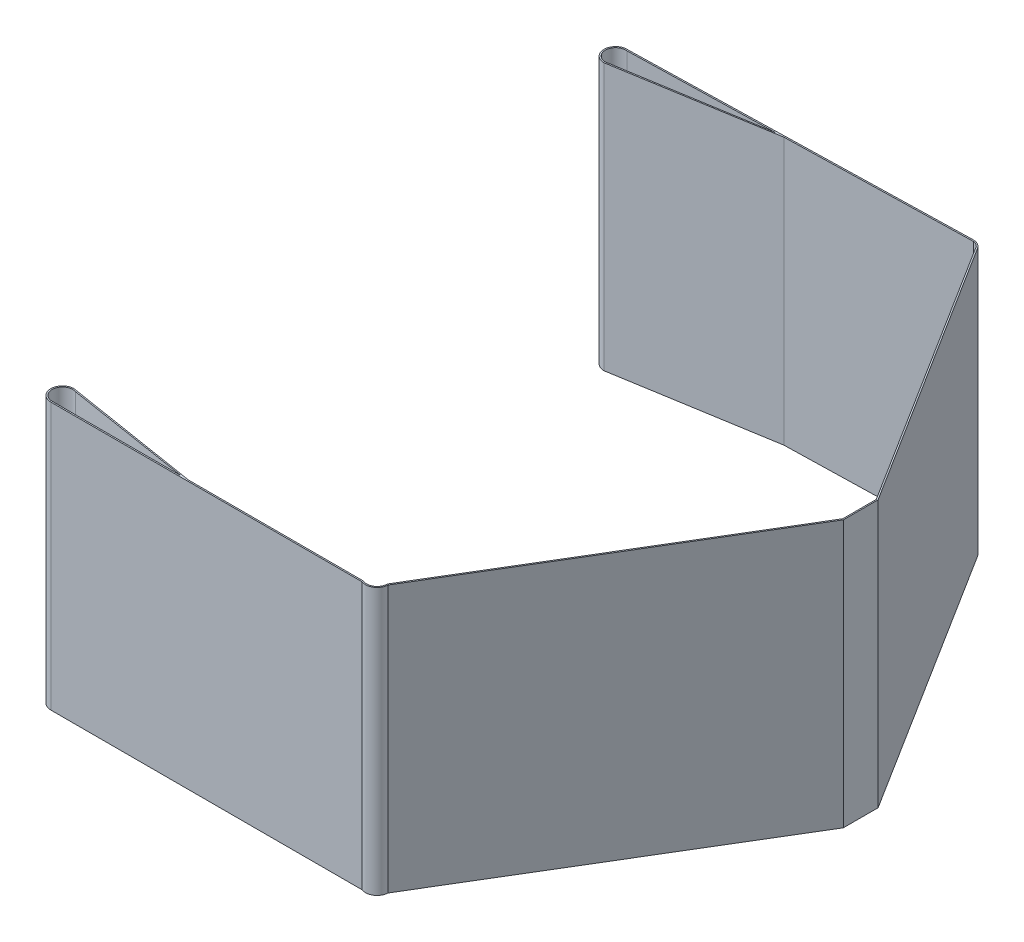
ISO-10303-21;
HEADER;
FILE_DESCRIPTION(('STEP AP214'),'2;1');
FILE_NAME('part.step','',(''),(''),'','','');
FILE_SCHEMA(('AUTOMOTIVE_DESIGN { 1 0 10303 214 1 1 1 1 }'));
ENDSEC;
DATA;
#1=APPLICATION_CONTEXT('core data for automotive mechanical design processes');
#2=APPLICATION_PROTOCOL_DEFINITION('international standard','automotive_design',2000,#1);
#3=PRODUCT_CONTEXT('',#1,'mechanical');
#4=PRODUCT('Part','Part','',(#3));
#5=PRODUCT_RELATED_PRODUCT_CATEGORY('part','',(#4));
#6=PRODUCT_DEFINITION_FORMATION('','',#4);
#7=PRODUCT_DEFINITION_CONTEXT('part definition',#1,'design');
#8=PRODUCT_DEFINITION('design','',#6,#7);
#9=PRODUCT_DEFINITION_SHAPE('','',#8);
#10=(LENGTH_UNIT() NAMED_UNIT(*) SI_UNIT(.MILLI.,.METRE.));
#11=(NAMED_UNIT(*) PLANE_ANGLE_UNIT() SI_UNIT($,.RADIAN.));
#12=(NAMED_UNIT(*) SI_UNIT($,.STERADIAN.) SOLID_ANGLE_UNIT());
#13=UNCERTAINTY_MEASURE_WITH_UNIT(LENGTH_MEASURE(1.E-05),#10,'distance_accuracy_value','');
#14=(GEOMETRIC_REPRESENTATION_CONTEXT(3) GLOBAL_UNCERTAINTY_ASSIGNED_CONTEXT((#13)) GLOBAL_UNIT_ASSIGNED_CONTEXT((#10,
#11,#12)) REPRESENTATION_CONTEXT('',''));
#15=CARTESIAN_POINT('',(0.,0.,0.));
#16=DIRECTION('',(0.,0.,1.));
#17=DIRECTION('',(1.,0.,0.));
#18=AXIS2_PLACEMENT_3D('',#15,#16,#17);
#19=CARTESIAN_POINT('',(-23.4349894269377,0.,-863.955645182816));
#20=DIRECTION('',(0.0242576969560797,0.,0.999705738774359));
#21=DIRECTION('',(0.999705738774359,0.,-0.0242576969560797));
#22=AXIS2_PLACEMENT_3D('',#19,#20,#21);
#23=PLANE('',#22);
#24=DIRECTION('',(0.,1.,0.));
#25=VECTOR('',#24,1.);
#26=CARTESIAN_POINT('',(189.00585008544,0.,-869.110487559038));
#27=LINE('',#26,#25);
#28=CARTESIAN_POINT('',(189.00585008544,0.,-869.110487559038));
#29=VERTEX_POINT('',#28);
#30=CARTESIAN_POINT('',(189.00585008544,390.,-869.110487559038));
#31=VERTEX_POINT('',#30);
#32=EDGE_CURVE('E427',#29,#31,#27,.T.);
#33=ORIENTED_EDGE('',*,*,#32,.T.);
#34=DIRECTION('',(0.999705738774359,0.,-0.0242576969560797));
#35=VECTOR('',#34,1.);
#36=CARTESIAN_POINT('',(-23.4349894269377,390.,-863.955645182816));
#37=LINE('',#36,#35);
#38=CARTESIAN_POINT('',(-23.4349894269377,390.,-863.955645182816));
#39=VERTEX_POINT('',#38);
#40=EDGE_CURVE('E217',#39,#31,#37,.T.);
#41=ORIENTED_EDGE('',*,*,#40,.F.);
#42=DIRECTION('',(0.,1.,0.));
#43=VECTOR('',#42,1.);
#44=CARTESIAN_POINT('',(-23.4349894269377,0.,-863.955645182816));
#45=LINE('',#44,#43);
#46=CARTESIAN_POINT('',(-23.4349894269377,0.,-863.955645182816));
#47=VERTEX_POINT('',#46);
#48=EDGE_CURVE('E201',#47,#39,#45,.T.);
#49=ORIENTED_EDGE('',*,*,#48,.F.);
#50=DIRECTION('',(0.999705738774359,0.,-0.0242576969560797));
#51=VECTOR('',#50,1.);
#52=CARTESIAN_POINT('',(-23.4349894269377,0.,-863.955645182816));
#53=LINE('',#52,#51);
#54=EDGE_CURVE('E215',#47,#29,#53,.T.);
#55=ORIENTED_EDGE('',*,*,#54,.T.);
#56=EDGE_LOOP('',(#33,#41,#49,#55));
#57=FACE_BOUND('',#56,.T.);
#58=ADVANCED_FACE('F34',(#57),#23,.T.);
#59=CARTESIAN_POINT('',(0.,390.,0.));
#60=DIRECTION('',(0.,0.,1.));
#61=DIRECTION('',(1.,0.,0.));
#62=AXIS2_PLACEMENT_3D('',#59,#60,#61);
#63=PLANE('',#62);
#64=DIRECTION('',(1.,0.,0.));
#65=VECTOR('',#64,1.);
#66=CARTESIAN_POINT('',(0.,0.,0.));
#67=LINE('',#66,#65);
#68=CARTESIAN_POINT('',(199.427806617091,0.,0.));
#69=VERTEX_POINT('',#68);
#70=CARTESIAN_POINT('',(455.,0.,0.));
#71=VERTEX_POINT('',#70);
#72=EDGE_CURVE('E352',#69,#71,#67,.T.);
#73=ORIENTED_EDGE('',*,*,#72,.F.);
#74=DIRECTION('',(0.,1.,0.));
#75=VECTOR('',#74,1.);
#76=CARTESIAN_POINT('',(199.427806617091,0.,0.));
#77=LINE('',#76,#75);
#78=CARTESIAN_POINT('',(199.427806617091,390.,0.));
#79=VERTEX_POINT('',#78);
#80=EDGE_CURVE('E338',#69,#79,#77,.T.);
#81=ORIENTED_EDGE('',*,*,#80,.T.);
#82=DIRECTION('',(-1.,0.,0.));
#83=VECTOR('',#82,1.);
#84=CARTESIAN_POINT('',(0.,390.,0.));
#85=LINE('',#84,#83);
#86=CARTESIAN_POINT('',(455.,390.,0.));
#87=VERTEX_POINT('',#86);
#88=EDGE_CURVE('E38',#87,#79,#85,.T.);
#89=ORIENTED_EDGE('',*,*,#88,.F.);
#90=DIRECTION('',(0.,1.,0.));
#91=VECTOR('',#90,1.);
#92=CARTESIAN_POINT('',(455.,390.,0.));
#93=LINE('',#92,#91);
#94=EDGE_CURVE('E355',#71,#87,#93,.T.);
#95=ORIENTED_EDGE('',*,*,#94,.F.);
#96=EDGE_LOOP('',(#73,#81,#89,#95));
#97=FACE_BOUND('',#96,.T.);
#98=ADVANCED_FACE('F366',(#97),#63,.F.);
#99=CARTESIAN_POINT('',(0.,0.,2.));
#100=DIRECTION('',(0.,1.,0.));
#101=DIRECTION('',(0.,0.,1.));
#102=AXIS2_PLACEMENT_3D('',#99,#100,#101);
#103=PLANE('',#102);
#104=DIRECTION('',(-0.986887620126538,0.,0.161408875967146));
#105=VECTOR('',#104,1.);
#106=CARTESIAN_POINT('',(-25.2582071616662,0.,-834.066861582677));
#107=LINE('',#106,#105);
#108=CARTESIAN_POINT('',(-25.2582071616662,0.,-834.066861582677));
#109=VERTEX_POINT('',#108);
#110=EDGE_CURVE('E222',#29,#109,#107,.T.);
#111=ORIENTED_EDGE('',*,*,#110,.F.);
#112=ORIENTED_EDGE('',*,*,#54,.F.);
#113=CARTESIAN_POINT('',(-25.2582071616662,0.,-849.066861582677));
#114=DIRECTION('',(0.,-1.,0.));
#115=DIRECTION('',(0.,0.,1.));
#116=AXIS2_PLACEMENT_3D('',#113,#114,#115);
#117=CIRCLE('',#116,15.);
#118=EDGE_CURVE('E197',#109,#47,#117,.T.);
#119=ORIENTED_EDGE('',*,*,#118,.F.);
#120=EDGE_LOOP('',(#111,#112,#119));
#121=FACE_BOUND('',#120,.T.);
#122=CARTESIAN_POINT('',(0.,0.,-15.));
#123=DIRECTION('',(0.,-1.,0.));
#124=DIRECTION('',(0.,0.,1.));
#125=AXIS2_PLACEMENT_3D('',#122,#123,#124);
#126=CIRCLE('',#125,15.);
#127=CARTESIAN_POINT('',(0.,0.,0.));
#128=VERTEX_POINT('',#127);
#129=CARTESIAN_POINT('',(4.67596387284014,0.,-29.252556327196));
#130=VERTEX_POINT('',#129);
#131=EDGE_CURVE('E318',#128,#130,#126,.T.);
#132=ORIENTED_EDGE('',*,*,#131,.F.);
#133=CARTESIAN_POINT('',(189.00585008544,0.,0.));
#134=VERTEX_POINT('',#133);
#135=EDGE_CURVE('E353',#128,#134,#67,.T.);
#136=ORIENTED_EDGE('',*,*,#135,.T.);
#137=DIRECTION('',(0.987640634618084,0.,0.156735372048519));
#138=VECTOR('',#137,1.);
#139=CARTESIAN_POINT('',(4.67596387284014,0.,-29.252556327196));
#140=LINE('',#139,#138);
#141=EDGE_CURVE('E322',#130,#134,#140,.T.);
#142=ORIENTED_EDGE('',*,*,#141,.F.);
#143=EDGE_LOOP('',(#132,#136,#142));
#144=FACE_BOUND('',#143,.T.);
#145=DIRECTION('',(1.,0.,0.));
#146=VECTOR('',#145,1.);
#147=CARTESIAN_POINT('',(0.,0.,2.));
#148=LINE('',#147,#146);
#149=CARTESIAN_POINT('',(0.,0.,2.));
#150=VERTEX_POINT('',#149);
#151=CARTESIAN_POINT('',(455.,0.,2.));
#152=VERTEX_POINT('',#151);
#153=EDGE_CURVE('E347',#150,#152,#148,.T.);
#154=ORIENTED_EDGE('',*,*,#153,.F.);
#155=CARTESIAN_POINT('',(0.,0.,-15.));
#156=DIRECTION('',(0.,1.,0.));
#157=DIRECTION('',(0.,0.,1.));
#158=AXIS2_PLACEMENT_3D('',#155,#156,#157);
#159=CIRCLE('',#158,17.);
#160=CARTESIAN_POINT('',(0.,0.,-32.));
#161=VERTEX_POINT('',#160);
#162=EDGE_CURVE('E315',#161,#150,#159,.T.);
#163=ORIENTED_EDGE('',*,*,#162,.F.);
#164=DIRECTION('',(-0.987369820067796,0.,-0.158432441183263));
#165=VECTOR('',#164,1.);
#166=CARTESIAN_POINT('',(0.,0.,-32.));
#167=LINE('',#166,#165);
#168=EDGE_CURVE('E324',#69,#161,#167,.T.);
#169=ORIENTED_EDGE('',*,*,#168,.F.);
#170=ORIENTED_EDGE('',*,*,#72,.T.);
#171=CARTESIAN_POINT('',(461.244160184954,0.,-13.811719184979));
#172=DIRECTION('',(0.,-1.,0.));
#173=DIRECTION('',(0.,0.,1.));
#174=AXIS2_PLACEMENT_3D('',#171,#172,#173);
#175=CIRCLE('',#174,15.1576094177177);
#176=CARTESIAN_POINT('',(476.401769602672,0.,-13.811719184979));
#177=VERTEX_POINT('',#176);
#178=EDGE_CURVE('E292',#177,#71,#175,.T.);
#179=ORIENTED_EDGE('',*,*,#178,.F.);
#180=DIRECTION('',(-0.516084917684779,0.,0.85653742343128));
#181=VECTOR('',#180,1.);
#182=CARTESIAN_POINT('',(476.401769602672,0.,-13.811719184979));
#183=LINE('',#182,#181);
#184=CARTESIAN_POINT('',(726.702954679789,0.,-429.23236954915));
#185=VERTEX_POINT('',#184);
#186=EDGE_CURVE('E289',#185,#177,#183,.T.);
#187=ORIENTED_EDGE('',*,*,#186,.F.);
#188=DIRECTION('',(0.,0.,1.));
#189=VECTOR('',#188,1.);
#190=CARTESIAN_POINT('',(726.702954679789,0.,-429.23236954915));
#191=LINE('',#190,#189);
#192=CARTESIAN_POINT('',(726.702954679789,0.,-478.23236954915));
#193=VERTEX_POINT('',#192);
#194=EDGE_CURVE('E260',#193,#185,#191,.T.);
#195=ORIENTED_EDGE('',*,*,#194,.F.);
#196=DIRECTION('',(0.531989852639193,0.,0.846750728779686));
#197=VECTOR('',#196,1.);
#198=CARTESIAN_POINT('',(479.445428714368,0.,-871.784030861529));
#199=LINE('',#198,#197);
#200=CARTESIAN_POINT('',(479.445428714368,0.,-871.784030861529));
#201=VERTEX_POINT('',#200);
#202=EDGE_CURVE('E257',#201,#193,#199,.T.);
#203=ORIENTED_EDGE('',*,*,#202,.F.);
#204=CARTESIAN_POINT('',(468.864516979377,0.,-861.151801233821));
#205=DIRECTION('',(0.,-1.,0.));
#206=DIRECTION('',(0.,0.,1.));
#207=AXIS2_PLACEMENT_3D('',#204,#205,#206);
#208=CIRCLE('',#207,14.9999999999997);
#209=CARTESIAN_POINT('',(471.25972771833,0.,-875.959331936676));
#210=VERTEX_POINT('',#209);
#211=EDGE_CURVE('E223',#210,#201,#208,.T.);
#212=ORIENTED_EDGE('',*,*,#211,.F.);
#213=CARTESIAN_POINT('',(200.595421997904,0.,-869.391706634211));
#214=VERTEX_POINT('',#213);
#215=EDGE_CURVE('E224',#214,#210,#53,.T.);
#216=ORIENTED_EDGE('',*,*,#215,.F.);
#217=DIRECTION('',(0.986626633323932,0.,-0.162996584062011));
#218=VECTOR('',#217,1.);
#219=CARTESIAN_POINT('',(-25.2582071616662,0.,-832.0793446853));
#220=LINE('',#219,#218);
#221=CARTESIAN_POINT('',(-25.2582071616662,0.,-832.0793446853));
#222=VERTEX_POINT('',#221);
#223=EDGE_CURVE('E414',#222,#214,#220,.T.);
#224=ORIENTED_EDGE('',*,*,#223,.F.);
#225=CARTESIAN_POINT('',(-25.2582071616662,0.,-849.066861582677));
#226=DIRECTION('',(0.,1.,0.));
#227=DIRECTION('',(0.,0.,1.));
#228=AXIS2_PLACEMENT_3D('',#225,#226,#227);
#229=CIRCLE('',#228,16.9875168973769);
#230=CARTESIAN_POINT('',(-23.4348302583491,0.,-865.956237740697));
#231=VERTEX_POINT('',#230);
#232=EDGE_CURVE('E208',#231,#222,#229,.T.);
#233=ORIENTED_EDGE('',*,*,#232,.F.);
#234=DIRECTION('',(-0.999705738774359,0.,0.0242576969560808));
#235=VECTOR('',#234,1.);
#236=CARTESIAN_POINT('',(468.864516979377,0.,-877.901801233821));
#237=LINE('',#236,#235);
#238=CARTESIAN_POINT('',(468.864516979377,0.,-877.901801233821));
#239=VERTEX_POINT('',#238);
#240=EDGE_CURVE('E228',#239,#231,#237,.T.);
#241=ORIENTED_EDGE('',*,*,#240,.F.);
#242=CARTESIAN_POINT('',(468.864516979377,0.,-861.151801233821));
#243=DIRECTION('',(0.,1.,0.));
#244=DIRECTION('',(0.,0.,1.));
#245=AXIS2_PLACEMENT_3D('',#242,#243,#244);
#246=CIRCLE('',#245,16.75);
#247=CARTESIAN_POINT('',(481.807398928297,0.,-871.784030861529));
#248=VERTEX_POINT('',#247);
#249=EDGE_CURVE('E243',#248,#239,#246,.T.);
#250=ORIENTED_EDGE('',*,*,#249,.F.);
#251=DIRECTION('',(-0.531989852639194,0.,-0.846750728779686));
#252=VECTOR('',#251,1.);
#253=CARTESIAN_POINT('',(728.523926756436,0.,-479.093458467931));
#254=LINE('',#253,#252);
#255=CARTESIAN_POINT('',(728.523926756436,0.,-479.093458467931));
#256=VERTEX_POINT('',#255);
#257=EDGE_CURVE('E253',#256,#248,#254,.T.);
#258=ORIENTED_EDGE('',*,*,#257,.F.);
#259=DIRECTION('',(0.,0.,-1.));
#260=VECTOR('',#259,1.);
#261=CARTESIAN_POINT('',(728.523926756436,0.,-428.379274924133));
#262=LINE('',#261,#260);
#263=CARTESIAN_POINT('',(728.523926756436,0.,-428.379274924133));
#264=VERTEX_POINT('',#263);
#265=EDGE_CURVE('E250',#264,#256,#262,.T.);
#266=ORIENTED_EDGE('',*,*,#265,.F.);
#267=DIRECTION('',(0.516084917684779,0.,-0.85653742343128));
#268=VECTOR('',#267,1.);
#269=CARTESIAN_POINT('',(478.222741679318,0.,-12.9586245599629));
#270=LINE('',#269,#268);
#271=CARTESIAN_POINT('',(478.222741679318,0.,-12.9586245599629));
#272=VERTEX_POINT('',#271);
#273=EDGE_CURVE('E286',#272,#264,#270,.T.);
#274=ORIENTED_EDGE('',*,*,#273,.F.);
#275=CARTESIAN_POINT('',(461.244160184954,0.,-13.811719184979));
#276=DIRECTION('',(0.,1.,0.));
#277=DIRECTION('',(0.,0.,1.));
#278=AXIS2_PLACEMENT_3D('',#275,#276,#277);
#279=CIRCLE('',#278,17.);
#280=EDGE_CURVE('E283',#152,#272,#279,.T.);
#281=ORIENTED_EDGE('',*,*,#280,.F.);
#282=EDGE_LOOP('',(#154,#163,#169,#170,#179,#187,#195,#203,#212,#216,#224,#233,#241,#250,#258,
#266,#274,#281));
#283=FACE_BOUND('',#282,.T.);
#284=ADVANCED_FACE('F36',(#121,#144,#283),#103,.F.);
#285=CARTESIAN_POINT('',(0.,390.,2.));
#286=DIRECTION('',(0.,-1.,0.));
#287=DIRECTION('',(0.,0.,-1.));
#288=AXIS2_PLACEMENT_3D('',#285,#286,#287);
#289=PLANE('',#288);
#290=ORIENTED_EDGE('',*,*,#40,.T.);
#291=DIRECTION('',(-0.986887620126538,0.,0.161408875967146));
#292=VECTOR('',#291,1.);
#293=CARTESIAN_POINT('',(-25.2582071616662,390.,-834.066861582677));
#294=LINE('',#293,#292);
#295=CARTESIAN_POINT('',(-25.2582071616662,390.,-834.066861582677));
#296=VERTEX_POINT('',#295);
#297=EDGE_CURVE('E209',#31,#296,#294,.T.);
#298=ORIENTED_EDGE('',*,*,#297,.T.);
#299=CARTESIAN_POINT('',(-25.2582071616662,390.,-849.066861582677));
#300=DIRECTION('',(0.,-1.,0.));
#301=DIRECTION('',(0.,0.,1.));
#302=AXIS2_PLACEMENT_3D('',#299,#300,#301);
#303=CIRCLE('',#302,15.);
#304=EDGE_CURVE('E420',#296,#39,#303,.T.);
#305=ORIENTED_EDGE('',*,*,#304,.T.);
#306=EDGE_LOOP('',(#290,#298,#305));
#307=FACE_BOUND('',#306,.T.);
#308=CARTESIAN_POINT('',(189.00585008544,390.,0.));
#309=VERTEX_POINT('',#308);
#310=CARTESIAN_POINT('',(0.,390.,0.));
#311=VERTEX_POINT('',#310);
#312=EDGE_CURVE('E357',#309,#311,#85,.T.);
#313=ORIENTED_EDGE('',*,*,#312,.T.);
#314=CARTESIAN_POINT('',(0.,390.,-15.));
#315=DIRECTION('',(0.,-1.,0.));
#316=DIRECTION('',(0.,0.,1.));
#317=AXIS2_PLACEMENT_3D('',#314,#315,#316);
#318=CIRCLE('',#317,15.);
#319=CARTESIAN_POINT('',(4.67596387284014,390.,-29.252556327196));
#320=VERTEX_POINT('',#319);
#321=EDGE_CURVE('E330',#311,#320,#318,.T.);
#322=ORIENTED_EDGE('',*,*,#321,.T.);
#323=DIRECTION('',(0.987640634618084,0.,0.156735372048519));
#324=VECTOR('',#323,1.);
#325=CARTESIAN_POINT('',(4.67596387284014,390.,-29.252556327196));
#326=LINE('',#325,#324);
#327=EDGE_CURVE('E59',#320,#309,#326,.T.);
#328=ORIENTED_EDGE('',*,*,#327,.T.);
#329=EDGE_LOOP('',(#313,#322,#328));
#330=FACE_BOUND('',#329,.T.);
#331=ORIENTED_EDGE('',*,*,#88,.T.);
#332=DIRECTION('',(-0.987369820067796,0.,-0.158432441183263));
#333=VECTOR('',#332,1.);
#334=CARTESIAN_POINT('',(0.,390.,-32.));
#335=LINE('',#334,#333);
#336=CARTESIAN_POINT('',(0.,390.,-32.));
#337=VERTEX_POINT('',#336);
#338=EDGE_CURVE('E319',#79,#337,#335,.T.);
#339=ORIENTED_EDGE('',*,*,#338,.T.);
#340=CARTESIAN_POINT('',(0.,390.,-15.));
#341=DIRECTION('',(0.,1.,0.));
#342=DIRECTION('',(0.,0.,1.));
#343=AXIS2_PLACEMENT_3D('',#340,#341,#342);
#344=CIRCLE('',#343,17.);
#345=CARTESIAN_POINT('',(0.,390.,2.));
#346=VERTEX_POINT('',#345);
#347=EDGE_CURVE('E308',#337,#346,#344,.T.);
#348=ORIENTED_EDGE('',*,*,#347,.T.);
#349=DIRECTION('',(-1.,0.,0.));
#350=VECTOR('',#349,1.);
#351=CARTESIAN_POINT('',(0.,390.,2.));
#352=LINE('',#351,#350);
#353=CARTESIAN_POINT('',(455.,390.,2.));
#354=VERTEX_POINT('',#353);
#355=EDGE_CURVE('E11',#354,#346,#352,.T.);
#356=ORIENTED_EDGE('',*,*,#355,.F.);
#357=CARTESIAN_POINT('',(461.244160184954,390.,-13.811719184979));
#358=DIRECTION('',(0.,1.,0.));
#359=DIRECTION('',(0.,0.,1.));
#360=AXIS2_PLACEMENT_3D('',#357,#358,#359);
#361=CIRCLE('',#360,17.);
#362=CARTESIAN_POINT('',(478.222741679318,390.,-12.9586245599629));
#363=VERTEX_POINT('',#362);
#364=EDGE_CURVE('E276',#354,#363,#361,.T.);
#365=ORIENTED_EDGE('',*,*,#364,.T.);
#366=DIRECTION('',(0.516084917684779,0.,-0.85653742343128));
#367=VECTOR('',#366,1.);
#368=CARTESIAN_POINT('',(478.222741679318,390.,-12.9586245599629));
#369=LINE('',#368,#367);
#370=CARTESIAN_POINT('',(728.523926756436,390.,-428.379274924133));
#371=VERTEX_POINT('',#370);
#372=EDGE_CURVE('E298',#363,#371,#369,.T.);
#373=ORIENTED_EDGE('',*,*,#372,.T.);
#374=DIRECTION('',(0.,0.,-1.));
#375=VECTOR('',#374,1.);
#376=CARTESIAN_POINT('',(728.523926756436,390.,-428.379274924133));
#377=LINE('',#376,#375);
#378=CARTESIAN_POINT('',(728.523926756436,390.,-479.093458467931));
#379=VERTEX_POINT('',#378);
#380=EDGE_CURVE('E245',#371,#379,#377,.T.);
#381=ORIENTED_EDGE('',*,*,#380,.T.);
#382=DIRECTION('',(-0.531989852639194,0.,-0.846750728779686));
#383=VECTOR('',#382,1.);
#384=CARTESIAN_POINT('',(728.523926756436,390.,-479.093458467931));
#385=LINE('',#384,#383);
#386=CARTESIAN_POINT('',(481.807398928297,390.,-871.784030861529));
#387=VERTEX_POINT('',#386);
#388=EDGE_CURVE('E266',#379,#387,#385,.T.);
#389=ORIENTED_EDGE('',*,*,#388,.T.);
#390=CARTESIAN_POINT('',(468.864516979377,390.,-861.151801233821));
#391=DIRECTION('',(0.,1.,0.));
#392=DIRECTION('',(0.,0.,1.));
#393=AXIS2_PLACEMENT_3D('',#390,#391,#392);
#394=CIRCLE('',#393,16.75);
#395=CARTESIAN_POINT('',(468.864516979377,390.,-877.901801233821));
#396=VERTEX_POINT('',#395);
#397=EDGE_CURVE('E232',#387,#396,#394,.T.);
#398=ORIENTED_EDGE('',*,*,#397,.T.);
#399=DIRECTION('',(-0.999705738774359,0.,0.0242576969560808));
#400=VECTOR('',#399,1.);
#401=CARTESIAN_POINT('',(468.864516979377,390.,-877.901801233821));
#402=LINE('',#401,#400);
#403=CARTESIAN_POINT('',(-23.4348302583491,390.,-865.956237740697));
#404=VERTEX_POINT('',#403);
#405=EDGE_CURVE('E235',#396,#404,#402,.T.);
#406=ORIENTED_EDGE('',*,*,#405,.T.);
#407=CARTESIAN_POINT('',(-25.2582071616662,390.,-849.066861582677));
#408=DIRECTION('',(0.,1.,0.));
#409=DIRECTION('',(0.,0.,1.));
#410=AXIS2_PLACEMENT_3D('',#407,#408,#409);
#411=CIRCLE('',#410,16.9875168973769);
#412=CARTESIAN_POINT('',(-25.2582071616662,390.,-832.0793446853));
#413=VERTEX_POINT('',#412);
#414=EDGE_CURVE('E411',#404,#413,#411,.T.);
#415=ORIENTED_EDGE('',*,*,#414,.T.);
#416=DIRECTION('',(0.986626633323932,0.,-0.162996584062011));
#417=VECTOR('',#416,1.);
#418=CARTESIAN_POINT('',(-25.2582071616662,390.,-832.0793446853));
#419=LINE('',#418,#417);
#420=CARTESIAN_POINT('',(200.595421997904,390.,-869.391706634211));
#421=VERTEX_POINT('',#420);
#422=EDGE_CURVE('E51',#413,#421,#419,.T.);
#423=ORIENTED_EDGE('',*,*,#422,.T.);
#424=CARTESIAN_POINT('',(471.25972771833,390.,-875.959331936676));
#425=VERTEX_POINT('',#424);
#426=EDGE_CURVE('E238',#421,#425,#37,.T.);
#427=ORIENTED_EDGE('',*,*,#426,.T.);
#428=CARTESIAN_POINT('',(468.864516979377,390.,-861.151801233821));
#429=DIRECTION('',(0.,-1.,0.));
#430=DIRECTION('',(0.,0.,1.));
#431=AXIS2_PLACEMENT_3D('',#428,#429,#430);
#432=CIRCLE('',#431,14.9999999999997);
#433=CARTESIAN_POINT('',(479.445428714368,390.,-871.784030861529));
#434=VERTEX_POINT('',#433);
#435=EDGE_CURVE('E240',#425,#434,#432,.T.);
#436=ORIENTED_EDGE('',*,*,#435,.T.);
#437=DIRECTION('',(0.531989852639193,0.,0.846750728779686));
#438=VECTOR('',#437,1.);
#439=CARTESIAN_POINT('',(479.445428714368,390.,-871.784030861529));
#440=LINE('',#439,#438);
#441=CARTESIAN_POINT('',(726.702954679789,390.,-478.23236954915));
#442=VERTEX_POINT('',#441);
#443=EDGE_CURVE('E269',#434,#442,#440,.T.);
#444=ORIENTED_EDGE('',*,*,#443,.T.);
#445=DIRECTION('',(0.,0.,1.));
#446=VECTOR('',#445,1.);
#447=CARTESIAN_POINT('',(726.702954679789,390.,-429.23236954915));
#448=LINE('',#447,#446);
#449=CARTESIAN_POINT('',(726.702954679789,390.,-429.23236954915));
#450=VERTEX_POINT('',#449);
#451=EDGE_CURVE('E254',#442,#450,#448,.T.);
#452=ORIENTED_EDGE('',*,*,#451,.T.);
#453=DIRECTION('',(-0.516084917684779,0.,0.85653742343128));
#454=VECTOR('',#453,1.);
#455=CARTESIAN_POINT('',(476.401769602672,390.,-13.811719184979));
#456=LINE('',#455,#454);
#457=CARTESIAN_POINT('',(476.401769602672,390.,-13.811719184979));
#458=VERTEX_POINT('',#457);
#459=EDGE_CURVE('E301',#450,#458,#456,.T.);
#460=ORIENTED_EDGE('',*,*,#459,.T.);
#461=CARTESIAN_POINT('',(461.244160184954,390.,-13.811719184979));
#462=DIRECTION('',(0.,-1.,0.));
#463=DIRECTION('',(0.,0.,1.));
#464=AXIS2_PLACEMENT_3D('',#461,#462,#463);
#465=CIRCLE('',#464,15.1576094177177);
#466=EDGE_CURVE('E287',#458,#87,#465,.T.);
#467=ORIENTED_EDGE('',*,*,#466,.T.);
#468=EDGE_LOOP('',(#331,#339,#348,#356,#365,#373,#381,#389,#398,#406,#415,#423,#427,#436,#444,
#452,#460,#467));
#469=FACE_BOUND('',#468,.T.);
#470=ADVANCED_FACE('F363',(#307,#330,#469),#289,.F.);
#471=CARTESIAN_POINT('',(0.,390.,2.));
#472=DIRECTION('',(0.,0.,1.));
#473=DIRECTION('',(1.,0.,0.));
#474=AXIS2_PLACEMENT_3D('',#471,#472,#473);
#475=PLANE('',#474);
#476=DIRECTION('',(0.,-1.,0.));
#477=VECTOR('',#476,1.);
#478=CARTESIAN_POINT('',(0.,390.,2.));
#479=LINE('',#478,#477);
#480=EDGE_CURVE('E344',#346,#150,#479,.T.);
#481=ORIENTED_EDGE('',*,*,#480,.T.);
#482=ORIENTED_EDGE('',*,*,#153,.T.);
#483=DIRECTION('',(0.,1.,0.));
#484=VECTOR('',#483,1.);
#485=CARTESIAN_POINT('',(455.,390.,2.));
#486=LINE('',#485,#484);
#487=EDGE_CURVE('E43',#152,#354,#486,.T.);
#488=ORIENTED_EDGE('',*,*,#487,.T.);
#489=ORIENTED_EDGE('',*,*,#355,.T.);
#490=EDGE_LOOP('',(#481,#482,#488,#489));
#491=FACE_BOUND('',#490,.T.);
#492=ADVANCED_FACE('F496',(#491),#475,.T.);
#493=ORIENTED_EDGE('',*,*,#312,.F.);
#494=DIRECTION('',(0.,1.,0.));
#495=VECTOR('',#494,1.);
#496=CARTESIAN_POINT('',(189.00585008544,0.,0.));
#497=LINE('',#496,#495);
#498=EDGE_CURVE('E341',#134,#309,#497,.T.);
#499=ORIENTED_EDGE('',*,*,#498,.F.);
#500=ORIENTED_EDGE('',*,*,#135,.F.);
#501=DIRECTION('',(0.,-1.,0.));
#502=VECTOR('',#501,1.);
#503=CARTESIAN_POINT('',(0.,390.,0.));
#504=LINE('',#503,#502);
#505=EDGE_CURVE('E337',#311,#128,#504,.T.);
#506=ORIENTED_EDGE('',*,*,#505,.F.);
#507=EDGE_LOOP('',(#493,#499,#500,#506));
#508=FACE_BOUND('',#507,.T.);
#509=ADVANCED_FACE('F469',(#508),#63,.F.);
#510=CARTESIAN_POINT('',(0.,0.,-15.));
#511=DIRECTION('',(0.,1.,0.));
#512=DIRECTION('',(0.,0.,1.));
#513=AXIS2_PLACEMENT_3D('',#510,#511,#512);
#514=CYLINDRICAL_SURFACE('',#513,17.);
#515=ORIENTED_EDGE('',*,*,#347,.F.);
#516=DIRECTION('',(0.,1.,0.));
#517=VECTOR('',#516,1.);
#518=CARTESIAN_POINT('',(0.,0.,-32.));
#519=LINE('',#518,#517);
#520=EDGE_CURVE('E335',#161,#337,#519,.T.);
#521=ORIENTED_EDGE('',*,*,#520,.F.);
#522=ORIENTED_EDGE('',*,*,#162,.T.);
#523=ORIENTED_EDGE('',*,*,#480,.F.);
#524=EDGE_LOOP('',(#515,#521,#522,#523));
#525=FACE_BOUND('',#524,.T.);
#526=ADVANCED_FACE('F378',(#525),#514,.T.);
#527=CARTESIAN_POINT('',(0.,0.,-32.));
#528=DIRECTION('',(0.158432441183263,0.,-0.987369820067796));
#529=DIRECTION('',(-0.987369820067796,0.,-0.158432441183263));
#530=AXIS2_PLACEMENT_3D('',#527,#528,#529);
#531=PLANE('',#530);
#532=ORIENTED_EDGE('',*,*,#338,.F.);
#533=ORIENTED_EDGE('',*,*,#80,.F.);
#534=ORIENTED_EDGE('',*,*,#168,.T.);
#535=ORIENTED_EDGE('',*,*,#520,.T.);
#536=EDGE_LOOP('',(#532,#533,#534,#535));
#537=FACE_BOUND('',#536,.T.);
#538=ADVANCED_FACE('F370',(#537),#531,.T.);
#539=CARTESIAN_POINT('',(4.67596387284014,0.,-29.252556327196));
#540=DIRECTION('',(-0.156735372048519,0.,0.987640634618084));
#541=DIRECTION('',(0.987640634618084,0.,0.156735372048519));
#542=AXIS2_PLACEMENT_3D('',#539,#540,#541);
#543=PLANE('',#542);
#544=ORIENTED_EDGE('',*,*,#327,.F.);
#545=DIRECTION('',(0.,1.,0.));
#546=VECTOR('',#545,1.);
#547=CARTESIAN_POINT('',(4.67596387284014,0.,-29.252556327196));
#548=LINE('',#547,#546);
#549=EDGE_CURVE('E327',#130,#320,#548,.T.);
#550=ORIENTED_EDGE('',*,*,#549,.F.);
#551=ORIENTED_EDGE('',*,*,#141,.T.);
#552=ORIENTED_EDGE('',*,*,#498,.T.);
#553=EDGE_LOOP('',(#544,#550,#551,#552));
#554=FACE_BOUND('',#553,.T.);
#555=ADVANCED_FACE('F509',(#554),#543,.T.);
#556=CARTESIAN_POINT('',(0.,0.,-15.));
#557=DIRECTION('',(0.,1.,0.));
#558=DIRECTION('',(0.,0.,1.));
#559=AXIS2_PLACEMENT_3D('',#556,#557,#558);
#560=CYLINDRICAL_SURFACE('',#559,15.);
#561=ORIENTED_EDGE('',*,*,#321,.F.);
#562=ORIENTED_EDGE('',*,*,#505,.T.);
#563=ORIENTED_EDGE('',*,*,#131,.T.);
#564=ORIENTED_EDGE('',*,*,#549,.T.);
#565=EDGE_LOOP('',(#561,#562,#563,#564));
#566=FACE_BOUND('',#565,.T.);
#567=ADVANCED_FACE('F460',(#566),#560,.F.);
#568=CARTESIAN_POINT('',(461.244160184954,0.,-13.811719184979));
#569=DIRECTION('',(0.,1.,0.));
#570=DIRECTION('',(0.,0.,1.));
#571=AXIS2_PLACEMENT_3D('',#568,#569,#570);
#572=CYLINDRICAL_SURFACE('',#571,17.);
#573=ORIENTED_EDGE('',*,*,#364,.F.);
#574=ORIENTED_EDGE('',*,*,#487,.F.);
#575=ORIENTED_EDGE('',*,*,#280,.T.);
#576=DIRECTION('',(0.,1.,0.));
#577=VECTOR('',#576,1.);
#578=CARTESIAN_POINT('',(478.222741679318,0.,-12.9586245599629));
#579=LINE('',#578,#577);
#580=EDGE_CURVE('E295',#272,#363,#579,.T.);
#581=ORIENTED_EDGE('',*,*,#580,.T.);
#582=EDGE_LOOP('',(#573,#574,#575,#581));
#583=FACE_BOUND('',#582,.T.);
#584=ADVANCED_FACE('F384',(#583),#572,.T.);
#585=CARTESIAN_POINT('',(461.244160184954,0.,-13.811719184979));
#586=DIRECTION('',(0.,1.,0.));
#587=DIRECTION('',(0.,0.,1.));
#588=AXIS2_PLACEMENT_3D('',#585,#586,#587);
#589=CYLINDRICAL_SURFACE('',#588,15.1576094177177);
#590=ORIENTED_EDGE('',*,*,#466,.F.);
#591=DIRECTION('',(0.,1.,0.));
#592=VECTOR('',#591,1.);
#593=CARTESIAN_POINT('',(476.401769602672,0.,-13.811719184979));
#594=LINE('',#593,#592);
#595=EDGE_CURVE('E306',#177,#458,#594,.T.);
#596=ORIENTED_EDGE('',*,*,#595,.F.);
#597=ORIENTED_EDGE('',*,*,#178,.T.);
#598=ORIENTED_EDGE('',*,*,#94,.T.);
#599=EDGE_LOOP('',(#590,#596,#597,#598));
#600=FACE_BOUND('',#599,.T.);
#601=ADVANCED_FACE('F452',(#600),#589,.F.);
#602=CARTESIAN_POINT('',(476.401769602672,0.,-13.811719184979));
#603=DIRECTION('',(-0.85653742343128,0.,-0.516084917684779));
#604=DIRECTION('',(-0.516084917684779,0.,0.85653742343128));
#605=AXIS2_PLACEMENT_3D('',#602,#603,#604);
#606=PLANE('',#605);
#607=ORIENTED_EDGE('',*,*,#459,.F.);
#608=DIRECTION('',(0.,1.,0.));
#609=VECTOR('',#608,1.);
#610=CARTESIAN_POINT('',(726.702954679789,0.,-429.23236954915));
#611=LINE('',#610,#609);
#612=EDGE_CURVE('E309',#185,#450,#611,.T.);
#613=ORIENTED_EDGE('',*,*,#612,.F.);
#614=ORIENTED_EDGE('',*,*,#186,.T.);
#615=ORIENTED_EDGE('',*,*,#595,.T.);
#616=EDGE_LOOP('',(#607,#613,#614,#615));
#617=FACE_BOUND('',#616,.T.);
#618=ADVANCED_FACE('F450',(#617),#606,.T.);
#619=CARTESIAN_POINT('',(478.222741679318,0.,-12.9586245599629));
#620=DIRECTION('',(0.856537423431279,0.,0.516084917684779));
#621=DIRECTION('',(0.516084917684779,0.,-0.856537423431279));
#622=AXIS2_PLACEMENT_3D('',#619,#620,#621);
#623=PLANE('',#622);
#624=ORIENTED_EDGE('',*,*,#372,.F.);
#625=ORIENTED_EDGE('',*,*,#580,.F.);
#626=ORIENTED_EDGE('',*,*,#273,.T.);
#627=DIRECTION('',(0.,1.,0.));
#628=VECTOR('',#627,1.);
#629=CARTESIAN_POINT('',(728.523926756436,0.,-428.379274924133));
#630=LINE('',#629,#628);
#631=EDGE_CURVE('E312',#264,#371,#630,.T.);
#632=ORIENTED_EDGE('',*,*,#631,.T.);
#633=EDGE_LOOP('',(#624,#625,#626,#632));
#634=FACE_BOUND('',#633,.T.);
#635=ADVANCED_FACE('F388',(#634),#623,.T.);
#636=CARTESIAN_POINT('',(726.702954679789,0.,-429.23236954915));
#637=DIRECTION('',(-1.,0.,0.));
#638=DIRECTION('',(0.,0.,1.));
#639=AXIS2_PLACEMENT_3D('',#636,#637,#638);
#640=PLANE('',#639);
#641=ORIENTED_EDGE('',*,*,#451,.F.);
#642=DIRECTION('',(0.,1.,0.));
#643=VECTOR('',#642,1.);
#644=CARTESIAN_POINT('',(726.702954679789,0.,-478.23236954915));
#645=LINE('',#644,#643);
#646=EDGE_CURVE('E274',#193,#442,#645,.T.);
#647=ORIENTED_EDGE('',*,*,#646,.F.);
#648=ORIENTED_EDGE('',*,*,#194,.T.);
#649=ORIENTED_EDGE('',*,*,#612,.T.);
#650=EDGE_LOOP('',(#641,#647,#648,#649));
#651=FACE_BOUND('',#650,.T.);
#652=ADVANCED_FACE('F448',(#651),#640,.T.);
#653=CARTESIAN_POINT('',(479.445428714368,0.,-871.784030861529));
#654=DIRECTION('',(-0.846750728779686,0.,0.531989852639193));
#655=DIRECTION('',(0.531989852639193,0.,0.846750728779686));
#656=AXIS2_PLACEMENT_3D('',#653,#654,#655);
#657=PLANE('',#656);
#658=ORIENTED_EDGE('',*,*,#443,.F.);
#659=DIRECTION('',(0.,1.,0.));
#660=VECTOR('',#659,1.);
#661=CARTESIAN_POINT('',(479.445428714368,0.,-871.784030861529));
#662=LINE('',#661,#660);
#663=EDGE_CURVE('E277',#201,#434,#662,.T.);
#664=ORIENTED_EDGE('',*,*,#663,.F.);
#665=ORIENTED_EDGE('',*,*,#202,.T.);
#666=ORIENTED_EDGE('',*,*,#646,.T.);
#667=EDGE_LOOP('',(#658,#664,#665,#666));
#668=FACE_BOUND('',#667,.T.);
#669=ADVANCED_FACE('F444',(#668),#657,.T.);
#670=CARTESIAN_POINT('',(728.523926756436,0.,-479.093458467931));
#671=DIRECTION('',(0.846750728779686,0.,-0.531989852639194));
#672=DIRECTION('',(-0.531989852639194,0.,-0.846750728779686));
#673=AXIS2_PLACEMENT_3D('',#670,#671,#672);
#674=PLANE('',#673);
#675=ORIENTED_EDGE('',*,*,#388,.F.);
#676=DIRECTION('',(0.,1.,0.));
#677=VECTOR('',#676,1.);
#678=CARTESIAN_POINT('',(728.523926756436,0.,-479.093458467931));
#679=LINE('',#678,#677);
#680=EDGE_CURVE('E263',#256,#379,#679,.T.);
#681=ORIENTED_EDGE('',*,*,#680,.F.);
#682=ORIENTED_EDGE('',*,*,#257,.T.);
#683=DIRECTION('',(0.,1.,0.));
#684=VECTOR('',#683,1.);
#685=CARTESIAN_POINT('',(481.807398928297,0.,-871.784030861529));
#686=LINE('',#685,#684);
#687=EDGE_CURVE('E279',#248,#387,#686,.T.);
#688=ORIENTED_EDGE('',*,*,#687,.T.);
#689=EDGE_LOOP('',(#675,#681,#682,#688));
#690=FACE_BOUND('',#689,.T.);
#691=ADVANCED_FACE('F397',(#690),#674,.T.);
#692=CARTESIAN_POINT('',(728.523926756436,0.,-428.379274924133));
#693=DIRECTION('',(1.,0.,0.));
#694=DIRECTION('',(0.,0.,-1.));
#695=AXIS2_PLACEMENT_3D('',#692,#693,#694);
#696=PLANE('',#695);
#697=ORIENTED_EDGE('',*,*,#380,.F.);
#698=ORIENTED_EDGE('',*,*,#631,.F.);
#699=ORIENTED_EDGE('',*,*,#265,.T.);
#700=ORIENTED_EDGE('',*,*,#680,.T.);
#701=EDGE_LOOP('',(#697,#698,#699,#700));
#702=FACE_BOUND('',#701,.T.);
#703=ADVANCED_FACE('F392',(#702),#696,.T.);
#704=CARTESIAN_POINT('',(468.864516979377,0.,-861.151801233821));
#705=DIRECTION('',(0.,1.,0.));
#706=DIRECTION('',(0.,0.,1.));
#707=AXIS2_PLACEMENT_3D('',#704,#705,#706);
#708=CYLINDRICAL_SURFACE('',#707,16.75);
#709=ORIENTED_EDGE('',*,*,#397,.F.);
#710=ORIENTED_EDGE('',*,*,#687,.F.);
#711=ORIENTED_EDGE('',*,*,#249,.T.);
#712=DIRECTION('',(0.,1.,0.));
#713=VECTOR('',#712,1.);
#714=CARTESIAN_POINT('',(468.864516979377,0.,-877.901801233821));
#715=LINE('',#714,#713);
#716=EDGE_CURVE('E226',#239,#396,#715,.T.);
#717=ORIENTED_EDGE('',*,*,#716,.T.);
#718=EDGE_LOOP('',(#709,#710,#711,#717));
#719=FACE_BOUND('',#718,.T.);
#720=ADVANCED_FACE('F400',(#719),#708,.T.);
#721=CARTESIAN_POINT('',(468.864516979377,0.,-861.151801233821));
#722=DIRECTION('',(0.,1.,0.));
#723=DIRECTION('',(0.,0.,1.));
#724=AXIS2_PLACEMENT_3D('',#721,#722,#723);
#725=CYLINDRICAL_SURFACE('',#724,14.9999999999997);
#726=ORIENTED_EDGE('',*,*,#435,.F.);
#727=DIRECTION('',(0.,1.,0.));
#728=VECTOR('',#727,1.);
#729=CARTESIAN_POINT('',(471.25972771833,0.,-875.959331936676));
#730=LINE('',#729,#728);
#731=EDGE_CURVE('E218',#210,#425,#730,.T.);
#732=ORIENTED_EDGE('',*,*,#731,.F.);
#733=ORIENTED_EDGE('',*,*,#211,.T.);
#734=ORIENTED_EDGE('',*,*,#663,.T.);
#735=EDGE_LOOP('',(#726,#732,#733,#734));
#736=FACE_BOUND('',#735,.T.);
#737=ADVANCED_FACE('F473',(#736),#725,.F.);
#738=DIRECTION('',(0.,1.,0.));
#739=VECTOR('',#738,1.);
#740=CARTESIAN_POINT('',(200.595421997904,0.,-869.391706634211));
#741=LINE('',#740,#739);
#742=EDGE_CURVE('E429',#214,#421,#741,.T.);
#743=ORIENTED_EDGE('',*,*,#742,.F.);
#744=ORIENTED_EDGE('',*,*,#215,.T.);
#745=ORIENTED_EDGE('',*,*,#731,.T.);
#746=ORIENTED_EDGE('',*,*,#426,.F.);
#747=EDGE_LOOP('',(#743,#744,#745,#746));
#748=FACE_BOUND('',#747,.T.);
#749=ADVANCED_FACE('F436',(#748),#23,.T.);
#750=CARTESIAN_POINT('',(468.864516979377,0.,-877.901801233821));
#751=DIRECTION('',(-0.0242576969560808,0.,-0.999705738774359));
#752=DIRECTION('',(-0.999705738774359,0.,0.0242576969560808));
#753=AXIS2_PLACEMENT_3D('',#750,#751,#752);
#754=PLANE('',#753);
#755=ORIENTED_EDGE('',*,*,#405,.F.);
#756=ORIENTED_EDGE('',*,*,#716,.F.);
#757=ORIENTED_EDGE('',*,*,#240,.T.);
#758=DIRECTION('',(0.,1.,0.));
#759=VECTOR('',#758,1.);
#760=CARTESIAN_POINT('',(-23.4348302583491,0.,-865.956237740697));
#761=LINE('',#760,#759);
#762=EDGE_CURVE('E219',#231,#404,#761,.T.);
#763=ORIENTED_EDGE('',*,*,#762,.T.);
#764=EDGE_LOOP('',(#755,#756,#757,#763));
#765=FACE_BOUND('',#764,.T.);
#766=ADVANCED_FACE('F406',(#765),#754,.T.);
#767=CARTESIAN_POINT('',(-25.2582071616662,0.,-849.066861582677));
#768=DIRECTION('',(0.,1.,0.));
#769=DIRECTION('',(0.,0.,1.));
#770=AXIS2_PLACEMENT_3D('',#767,#768,#769);
#771=CYLINDRICAL_SURFACE('',#770,15.);
#772=ORIENTED_EDGE('',*,*,#304,.F.);
#773=DIRECTION('',(0.,1.,0.));
#774=VECTOR('',#773,1.);
#775=CARTESIAN_POINT('',(-25.2582071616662,0.,-834.066861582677));
#776=LINE('',#775,#774);
#777=EDGE_CURVE('E203',#109,#296,#776,.T.);
#778=ORIENTED_EDGE('',*,*,#777,.F.);
#779=ORIENTED_EDGE('',*,*,#118,.T.);
#780=ORIENTED_EDGE('',*,*,#48,.T.);
#781=EDGE_LOOP('',(#772,#778,#779,#780));
#782=FACE_BOUND('',#781,.T.);
#783=ADVANCED_FACE('F200',(#782),#771,.F.);
#784=CARTESIAN_POINT('',(-25.2582071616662,0.,-834.066861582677));
#785=DIRECTION('',(-0.161408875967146,0.,-0.986887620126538));
#786=DIRECTION('',(-0.986887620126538,0.,0.161408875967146));
#787=AXIS2_PLACEMENT_3D('',#784,#785,#786);
#788=PLANE('',#787);
#789=ORIENTED_EDGE('',*,*,#297,.F.);
#790=ORIENTED_EDGE('',*,*,#32,.F.);
#791=ORIENTED_EDGE('',*,*,#110,.T.);
#792=ORIENTED_EDGE('',*,*,#777,.T.);
#793=EDGE_LOOP('',(#789,#790,#791,#792));
#794=FACE_BOUND('',#793,.T.);
#795=ADVANCED_FACE('F485',(#794),#788,.T.);
#796=CARTESIAN_POINT('',(-25.2582071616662,0.,-832.0793446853));
#797=DIRECTION('',(0.162996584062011,0.,0.986626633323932));
#798=DIRECTION('',(0.986626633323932,0.,-0.162996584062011));
#799=AXIS2_PLACEMENT_3D('',#796,#797,#798);
#800=PLANE('',#799);
#801=ORIENTED_EDGE('',*,*,#422,.F.);
#802=DIRECTION('',(0.,1.,0.));
#803=VECTOR('',#802,1.);
#804=CARTESIAN_POINT('',(-25.2582071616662,0.,-832.0793446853));
#805=LINE('',#804,#803);
#806=EDGE_CURVE('E419',#222,#413,#805,.T.);
#807=ORIENTED_EDGE('',*,*,#806,.F.);
#808=ORIENTED_EDGE('',*,*,#223,.T.);
#809=ORIENTED_EDGE('',*,*,#742,.T.);
#810=EDGE_LOOP('',(#801,#807,#808,#809));
#811=FACE_BOUND('',#810,.T.);
#812=ADVANCED_FACE('F432',(#811),#800,.T.);
#813=CARTESIAN_POINT('',(-25.2582071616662,0.,-849.066861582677));
#814=DIRECTION('',(0.,1.,0.));
#815=DIRECTION('',(0.,0.,1.));
#816=AXIS2_PLACEMENT_3D('',#813,#814,#815);
#817=CYLINDRICAL_SURFACE('',#816,16.9875168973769);
#818=ORIENTED_EDGE('',*,*,#414,.F.);
#819=ORIENTED_EDGE('',*,*,#762,.F.);
#820=ORIENTED_EDGE('',*,*,#232,.T.);
#821=ORIENTED_EDGE('',*,*,#806,.T.);
#822=EDGE_LOOP('',(#818,#819,#820,#821));
#823=FACE_BOUND('',#822,.T.);
#824=ADVANCED_FACE('F410',(#823),#817,.T.);
#825=CLOSED_SHELL('',(#58,#98,#284,#470,#492,#509,#526,#538,#555,#567,#584,#601,#618,#635,#652,
#669,#691,#703,#720,#737,#749,#766,#783,#795,#812,#824));
#826=MANIFOLD_SOLID_BREP('B2',#825);
#827=ADVANCED_BREP_SHAPE_REPRESENTATION('',(#18,#826),#14);
#828=SHAPE_DEFINITION_REPRESENTATION(#9,#827);
ENDSEC;
END-ISO-10303-21;
